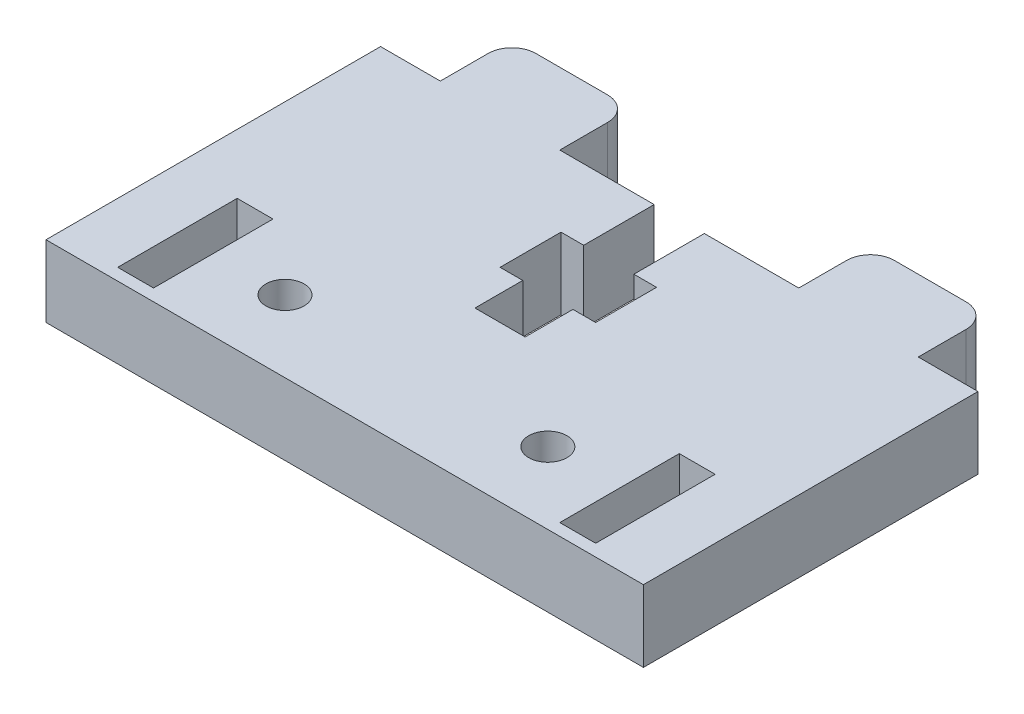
from build123d import *

# Parameters (mm, degrees)
SKETCH_1_W      = 3
SKETCH_1_H      = 10
SKETCH_1_R      = 1.6
EXTRUDE_1_DEPTH = 6


with BuildPart() as part:
    # Sketch 1 → Extrude 1 (new body)
    # profile 1 of 3: a face of its own
    with BuildSketch(Plane(origin=(0, 0, 0), x_dir=(1, 0, 0), z_dir=(0, 1, 0))):
        with BuildLine():
            Line((35, 28), (45, 28))
            Line((45, 28), (45, 32))
            ThreePointArc((45, 32), (44.414213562, 33.414213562), (43, 34))
            Line((43, 34), (37, 34))
            ThreePointArc((37, 34), (35.585786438, 33.414213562), (35, 32))
            Line((35, 32), (35, 28))
        make_face()
    # profile 2 of 3: a face of its own
    with BuildSketch(Plane(origin=(0, 0, 0), x_dir=(1, 0, 0), z_dir=(0, 1, 0))):
        Polygon((0, 28), (0, 0), (50, 0), (50, 28), (45, 28), (35, 28), (27.1, 28), (27.1, 22.1), (29, 22.1), (29, 17), (27.1, 17), (27.1, 13), (22.9, 13), (22.9, 17), (21, 17), (21, 22.1), (22.9, 22.1), (22.9, 28), (15, 28), (5, 28), align=None)
        with Locations((6.5, 6)):
            Rectangle(SKETCH_1_W, SKETCH_1_H, mode=Mode.SUBTRACT)
        with Locations(Location((14, 6, 0), (0, 0, 270))):
            Circle(SKETCH_1_R, mode=Mode.SUBTRACT)
        with Locations(Location((36, 6, 0), (0, 0, 270))):
            Circle(SKETCH_1_R, mode=Mode.SUBTRACT)
        with Locations((43.5, 6)):
            Rectangle(SKETCH_1_W, SKETCH_1_H, mode=Mode.SUBTRACT)
    # profile 3 of 3: a face of its own
    with BuildSketch(Plane(origin=(0, 0, 0), x_dir=(1, 0, 0), z_dir=(0, 1, 0))):
        with BuildLine():
            Line((7, 34), (13, 34))
            ThreePointArc((13, 34), (14.414213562, 33.414213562), (15, 32))
            Line((15, 32), (15, 28))
            Line((15, 28), (5, 28))
            Line((5, 28), (5, 32))
            ThreePointArc((5, 32), (5.585786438, 33.414213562), (7, 34))
        make_face()
    extrude(amount=EXTRUDE_1_DEPTH)


solid = part.part
